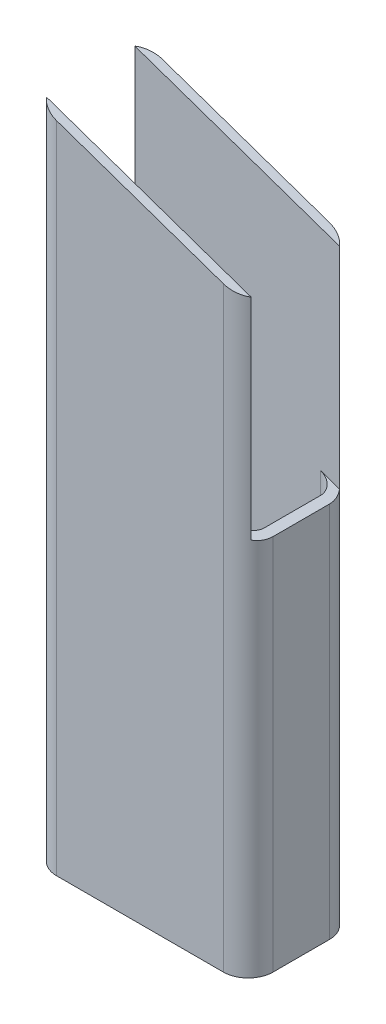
ISO-10303-21;
HEADER;
FILE_DESCRIPTION(('STEP AP214'),'2;1');
FILE_NAME('part.step','',(''),(''),'','','');
FILE_SCHEMA(('AUTOMOTIVE_DESIGN { 1 0 10303 214 1 1 1 1 }'));
ENDSEC;
DATA;
#1=APPLICATION_CONTEXT('core data for automotive mechanical design processes');
#2=APPLICATION_PROTOCOL_DEFINITION('international standard','automotive_design',2000,#1);
#3=PRODUCT_CONTEXT('',#1,'mechanical');
#4=PRODUCT('Part','Part','',(#3));
#5=PRODUCT_RELATED_PRODUCT_CATEGORY('part','',(#4));
#6=PRODUCT_DEFINITION_FORMATION('','',#4);
#7=PRODUCT_DEFINITION_CONTEXT('part definition',#1,'design');
#8=PRODUCT_DEFINITION('design','',#6,#7);
#9=PRODUCT_DEFINITION_SHAPE('','',#8);
#10=(LENGTH_UNIT() NAMED_UNIT(*) SI_UNIT(.MILLI.,.METRE.));
#11=(NAMED_UNIT(*) PLANE_ANGLE_UNIT() SI_UNIT($,.RADIAN.));
#12=(NAMED_UNIT(*) SI_UNIT($,.STERADIAN.) SOLID_ANGLE_UNIT());
#13=UNCERTAINTY_MEASURE_WITH_UNIT(LENGTH_MEASURE(1.E-05),#10,'distance_accuracy_value','');
#14=(GEOMETRIC_REPRESENTATION_CONTEXT(3) GLOBAL_UNCERTAINTY_ASSIGNED_CONTEXT((#13)) GLOBAL_UNIT_ASSIGNED_CONTEXT((#10,
#11,#12)) REPRESENTATION_CONTEXT('',''));
#15=CARTESIAN_POINT('',(0.,0.,0.));
#16=DIRECTION('',(0.,0.,1.));
#17=DIRECTION('',(1.,0.,0.));
#18=AXIS2_PLACEMENT_3D('',#15,#16,#17);
#19=CARTESIAN_POINT('',(98.,232.053333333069,-48.0000000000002));
#20=DIRECTION('',(-0.327543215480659,-0.944836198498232,0.));
#21=DIRECTION('',(0.944836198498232,-0.327543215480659,0.));
#22=AXIS2_PLACEMENT_3D('',#19,#20,#21);
#23=PLANE('',#22);
#24=DIRECTION('',(-0.944836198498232,0.327543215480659,0.));
#25=VECTOR('',#24,1.);
#26=CARTESIAN_POINT('',(-10.5138866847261,269.671480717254,-40.0000000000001));
#27=LINE('',#26,#25);
#28=CARTESIAN_POINT('',(92.7046505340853,233.88905448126,-40.));
#29=VERTEX_POINT('',#28);
#30=CARTESIAN_POINT('',(-92.7046505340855,298.164278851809,-40.));
#31=VERTEX_POINT('',#30);
#32=EDGE_CURVE('E187',#29,#31,#27,.T.);
#33=ORIENTED_EDGE('',*,*,#32,.F.);
#34=CARTESIAN_POINT('',(75.5,239.8533333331,-25.5000000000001));
#35=DIRECTION('',(-0.327543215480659,-0.944836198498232,0.));
#36=DIRECTION('',(0.944836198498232,-0.327543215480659,0.));
#37=AXIS2_PLACEMENT_3D('',#34,#35,#36);
#38=ELLIPSE('',#37,23.8136515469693,22.5);
#39=CARTESIAN_POINT('',(75.5,239.8533333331,-48.0000000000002));
#40=VERTEX_POINT('',#39);
#41=EDGE_CURVE('E202',#40,#29,#38,.T.);
#42=ORIENTED_EDGE('',*,*,#41,.F.);
#43=DIRECTION('',(0.944836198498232,-0.327543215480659,0.));
#44=VECTOR('',#43,1.);
#45=CARTESIAN_POINT('',(98.,232.053333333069,-48.0000000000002));
#46=LINE('',#45,#44);
#47=CARTESIAN_POINT('',(-75.5,292.19999999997,-48.0000000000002));
#48=VERTEX_POINT('',#47);
#49=EDGE_CURVE('E320',#48,#40,#46,.T.);
#50=ORIENTED_EDGE('',*,*,#49,.F.);
#51=CARTESIAN_POINT('',(-75.5,292.19999999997,-25.5000000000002));
#52=DIRECTION('',(-0.327543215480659,-0.944836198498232,0.));
#53=DIRECTION('',(0.944836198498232,-0.327543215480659,0.));
#54=AXIS2_PLACEMENT_3D('',#51,#52,#53);
#55=ELLIPSE('',#54,23.8136515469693,22.5);
#56=EDGE_CURVE('E208',#48,#31,#55,.F.);
#57=ORIENTED_EDGE('',*,*,#56,.T.);
#58=EDGE_LOOP('',(#33,#42,#50,#57));
#59=FACE_BOUND('',#58,.T.);
#60=ADVANCED_FACE('F40',(#59),#23,.F.);
#61=CARTESIAN_POINT('',(90.,300.,0.));
#62=DIRECTION('',(1.,0.,0.));
#63=DIRECTION('',(0.,0.,-1.));
#64=AXIS2_PLACEMENT_3D('',#61,#62,#63);
#65=PLANE('',#64);
#66=DIRECTION('',(0.,-1.,0.));
#67=VECTOR('',#66,1.);
#68=CARTESIAN_POINT('',(90.,300.,25.5));
#69=LINE('',#68,#67);
#70=CARTESIAN_POINT('',(90.,44.3166666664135,25.5));
#71=VERTEX_POINT('',#70);
#72=CARTESIAN_POINT('',(90.,-300.,25.5));
#73=VERTEX_POINT('',#72);
#74=EDGE_CURVE('E48',#71,#73,#69,.T.);
#75=ORIENTED_EDGE('',*,*,#74,.F.);
#76=DIRECTION('',(0.,0.,-1.));
#77=VECTOR('',#76,1.);
#78=CARTESIAN_POINT('',(90.,44.3166666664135,0.));
#79=LINE('',#78,#77);
#80=CARTESIAN_POINT('',(90.,44.3166666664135,-25.5000000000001));
#81=VERTEX_POINT('',#80);
#82=EDGE_CURVE('E357',#71,#81,#79,.T.);
#83=ORIENTED_EDGE('',*,*,#82,.T.);
#84=DIRECTION('',(0.,-1.,0.));
#85=VECTOR('',#84,1.);
#86=CARTESIAN_POINT('',(90.,300.,-25.5000000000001));
#87=LINE('',#86,#85);
#88=CARTESIAN_POINT('',(90.,-300.,-25.5000000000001));
#89=VERTEX_POINT('',#88);
#90=EDGE_CURVE('E63',#81,#89,#87,.T.);
#91=ORIENTED_EDGE('',*,*,#90,.T.);
#92=DIRECTION('',(0.,0.,1.));
#93=VECTOR('',#92,1.);
#94=CARTESIAN_POINT('',(90.,-300.,0.));
#95=LINE('',#94,#93);
#96=EDGE_CURVE('E232',#89,#73,#95,.T.);
#97=ORIENTED_EDGE('',*,*,#96,.T.);
#98=EDGE_LOOP('',(#75,#83,#91,#97));
#99=FACE_BOUND('',#98,.T.);
#100=ADVANCED_FACE('F408',(#99),#65,.F.);
#101=CARTESIAN_POINT('',(75.5,300.,25.5));
#102=DIRECTION('',(0.,-1.,0.));
#103=DIRECTION('',(0.,0.,-1.));
#104=AXIS2_PLACEMENT_3D('',#101,#102,#103);
#105=CYLINDRICAL_SURFACE('',#104,14.5);
#106=DIRECTION('',(0.,-1.,0.));
#107=VECTOR('',#106,1.);
#108=CARTESIAN_POINT('',(75.5,300.,40.));
#109=LINE('',#108,#107);
#110=CARTESIAN_POINT('',(75.5,49.3433333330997,40.));
#111=VERTEX_POINT('',#110);
#112=CARTESIAN_POINT('',(75.5,-300.,40.));
#113=VERTEX_POINT('',#112);
#114=EDGE_CURVE('E268',#111,#113,#109,.T.);
#115=ORIENTED_EDGE('',*,*,#114,.F.);
#116=CARTESIAN_POINT('',(75.5,49.3433333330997,25.5));
#117=DIRECTION('',(-0.327543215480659,-0.944836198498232,0.));
#118=DIRECTION('',(0.944836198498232,-0.327543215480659,0.));
#119=AXIS2_PLACEMENT_3D('',#116,#117,#118);
#120=ELLIPSE('',#119,15.3465754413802,14.5);
#121=EDGE_CURVE('E359',#111,#71,#120,.F.);
#122=ORIENTED_EDGE('',*,*,#121,.T.);
#123=ORIENTED_EDGE('',*,*,#74,.T.);
#124=CARTESIAN_POINT('',(75.5,-300.,25.5));
#125=DIRECTION('',(0.,1.,0.));
#126=DIRECTION('',(0.,0.,1.));
#127=AXIS2_PLACEMENT_3D('',#124,#125,#126);
#128=CIRCLE('',#127,14.5);
#129=EDGE_CURVE('E234',#73,#113,#128,.F.);
#130=ORIENTED_EDGE('',*,*,#129,.T.);
#131=EDGE_LOOP('',(#115,#122,#123,#130));
#132=FACE_BOUND('',#131,.T.);
#133=ADVANCED_FACE('F371',(#132),#105,.F.);
#134=CARTESIAN_POINT('',(0.,300.,40.));
#135=DIRECTION('',(0.,0.,-1.));
#136=DIRECTION('',(-1.,0.,0.));
#137=AXIS2_PLACEMENT_3D('',#134,#135,#136);
#138=PLANE('',#137);
#139=DIRECTION('',(0.,-1.,0.));
#140=VECTOR('',#139,1.);
#141=CARTESIAN_POINT('',(-75.5,300.,40.0000000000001));
#142=LINE('',#141,#140);
#143=CARTESIAN_POINT('',(-75.5,101.68999999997,40.));
#144=VERTEX_POINT('',#143);
#145=CARTESIAN_POINT('',(-75.5,-300.,40.0000000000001));
#146=VERTEX_POINT('',#145);
#147=EDGE_CURVE('E266',#144,#146,#142,.T.);
#148=ORIENTED_EDGE('',*,*,#147,.F.);
#149=DIRECTION('',(0.944836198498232,-0.327543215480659,0.));
#150=VECTOR('',#149,1.);
#151=CARTESIAN_POINT('',(-98.,109.49,40.));
#152=LINE('',#151,#150);
#153=CARTESIAN_POINT('',(-92.7046505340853,107.654278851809,40.));
#154=VERTEX_POINT('',#153);
#155=EDGE_CURVE('E364',#154,#144,#152,.T.);
#156=ORIENTED_EDGE('',*,*,#155,.F.);
#157=DIRECTION('',(0.,-1.,0.));
#158=VECTOR('',#157,1.);
#159=CARTESIAN_POINT('',(-92.7046505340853,300.,40.));
#160=LINE('',#159,#158);
#161=CARTESIAN_POINT('',(-92.7046505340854,298.164278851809,40.));
#162=VERTEX_POINT('',#161);
#163=EDGE_CURVE('E184',#162,#154,#160,.T.);
#164=ORIENTED_EDGE('',*,*,#163,.F.);
#165=DIRECTION('',(-0.944836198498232,0.327543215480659,0.));
#166=VECTOR('',#165,1.);
#167=CARTESIAN_POINT('',(-10.5138866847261,269.671480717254,40.));
#168=LINE('',#167,#166);
#169=CARTESIAN_POINT('',(92.7046505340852,233.88905448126,40.));
#170=VERTEX_POINT('',#169);
#171=EDGE_CURVE('E55',#170,#162,#168,.T.);
#172=ORIENTED_EDGE('',*,*,#171,.F.);
#173=DIRECTION('',(0.,-1.,0.));
#174=VECTOR('',#173,1.);
#175=CARTESIAN_POINT('',(92.7046505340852,300.,40.));
#176=LINE('',#175,#174);
#177=CARTESIAN_POINT('',(92.7046505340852,43.3790544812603,40.));
#178=VERTEX_POINT('',#177);
#179=EDGE_CURVE('E180',#170,#178,#176,.T.);
#180=ORIENTED_EDGE('',*,*,#179,.T.);
#181=EDGE_CURVE('E367',#111,#178,#152,.T.);
#182=ORIENTED_EDGE('',*,*,#181,.F.);
#183=ORIENTED_EDGE('',*,*,#114,.T.);
#184=DIRECTION('',(1.,0.,0.));
#185=VECTOR('',#184,1.);
#186=CARTESIAN_POINT('',(0.,-300.,40.));
#187=LINE('',#186,#185);
#188=EDGE_CURVE('E237',#146,#113,#187,.T.);
#189=ORIENTED_EDGE('',*,*,#188,.F.);
#190=EDGE_LOOP('',(#148,#156,#164,#172,#180,#182,#183,#189));
#191=FACE_BOUND('',#190,.T.);
#192=ADVANCED_FACE('F178',(#191),#138,.T.);
#193=CARTESIAN_POINT('',(-75.5,300.,25.5000000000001));
#194=DIRECTION('',(0.,-1.,0.));
#195=DIRECTION('',(0.,0.,-1.));
#196=AXIS2_PLACEMENT_3D('',#193,#194,#195);
#197=CYLINDRICAL_SURFACE('',#196,14.5);
#198=CARTESIAN_POINT('',(-75.5,101.68999999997,25.5000000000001));
#199=DIRECTION('',(-0.327543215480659,-0.944836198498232,0.));
#200=DIRECTION('',(0.944836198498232,-0.327543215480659,0.));
#201=AXIS2_PLACEMENT_3D('',#198,#199,#200);
#202=ELLIPSE('',#201,15.3465754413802,14.5);
#203=CARTESIAN_POINT('',(-90.,106.716666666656,25.5000000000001));
#204=VERTEX_POINT('',#203);
#205=EDGE_CURVE('E318',#144,#204,#202,.T.);
#206=ORIENTED_EDGE('',*,*,#205,.F.);
#207=ORIENTED_EDGE('',*,*,#147,.T.);
#208=CARTESIAN_POINT('',(-75.5,-300.,25.5000000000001));
#209=DIRECTION('',(0.,1.,0.));
#210=DIRECTION('',(0.,0.,1.));
#211=AXIS2_PLACEMENT_3D('',#208,#209,#210);
#212=CIRCLE('',#211,14.5);
#213=CARTESIAN_POINT('',(-90.,-300.,25.5000000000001));
#214=VERTEX_POINT('',#213);
#215=EDGE_CURVE('E240',#214,#146,#212,.T.);
#216=ORIENTED_EDGE('',*,*,#215,.F.);
#217=DIRECTION('',(0.,-1.,0.));
#218=VECTOR('',#217,1.);
#219=CARTESIAN_POINT('',(-90.,300.,25.5000000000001));
#220=LINE('',#219,#218);
#221=EDGE_CURVE('E264',#204,#214,#220,.T.);
#222=ORIENTED_EDGE('',*,*,#221,.F.);
#223=EDGE_LOOP('',(#206,#207,#216,#222));
#224=FACE_BOUND('',#223,.T.);
#225=ADVANCED_FACE('F379',(#224),#197,.F.);
#226=CARTESIAN_POINT('',(-90.,300.,0.));
#227=DIRECTION('',(1.,0.,0.));
#228=DIRECTION('',(0.,0.,-1.));
#229=AXIS2_PLACEMENT_3D('',#226,#227,#228);
#230=PLANE('',#229);
#231=DIRECTION('',(0.,0.,-1.));
#232=VECTOR('',#231,1.);
#233=CARTESIAN_POINT('',(-90.,106.716666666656,0.));
#234=LINE('',#233,#232);
#235=CARTESIAN_POINT('',(-90.,106.716666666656,-25.5000000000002));
#236=VERTEX_POINT('',#235);
#237=EDGE_CURVE('E316',#204,#236,#234,.T.);
#238=ORIENTED_EDGE('',*,*,#237,.F.);
#239=ORIENTED_EDGE('',*,*,#221,.T.);
#240=DIRECTION('',(0.,0.,1.));
#241=VECTOR('',#240,1.);
#242=CARTESIAN_POINT('',(-90.,-300.,0.));
#243=LINE('',#242,#241);
#244=CARTESIAN_POINT('',(-90.,-300.,-25.5000000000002));
#245=VERTEX_POINT('',#244);
#246=EDGE_CURVE('E243',#245,#214,#243,.T.);
#247=ORIENTED_EDGE('',*,*,#246,.F.);
#248=DIRECTION('',(0.,-1.,0.));
#249=VECTOR('',#248,1.);
#250=CARTESIAN_POINT('',(-90.,300.,-25.5000000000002));
#251=LINE('',#250,#249);
#252=EDGE_CURVE('E262',#236,#245,#251,.T.);
#253=ORIENTED_EDGE('',*,*,#252,.F.);
#254=EDGE_LOOP('',(#238,#239,#247,#253));
#255=FACE_BOUND('',#254,.T.);
#256=ADVANCED_FACE('F383',(#255),#230,.T.);
#257=CARTESIAN_POINT('',(-75.5,300.,-25.5000000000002));
#258=DIRECTION('',(0.,-1.,0.));
#259=DIRECTION('',(0.,0.,-1.));
#260=AXIS2_PLACEMENT_3D('',#257,#258,#259);
#261=CYLINDRICAL_SURFACE('',#260,14.5);
#262=DIRECTION('',(0.,-1.,0.));
#263=VECTOR('',#262,1.);
#264=CARTESIAN_POINT('',(-75.5,300.,-40.0000000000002));
#265=LINE('',#264,#263);
#266=CARTESIAN_POINT('',(-75.5,101.68999999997,-40.));
#267=VERTEX_POINT('',#266);
#268=CARTESIAN_POINT('',(-75.5,-300.,-40.0000000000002));
#269=VERTEX_POINT('',#268);
#270=EDGE_CURVE('E260',#267,#269,#265,.T.);
#271=ORIENTED_EDGE('',*,*,#270,.F.);
#272=CARTESIAN_POINT('',(-75.5,101.68999999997,-25.5000000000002));
#273=DIRECTION('',(-0.327543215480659,-0.944836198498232,0.));
#274=DIRECTION('',(0.944836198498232,-0.327543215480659,0.));
#275=AXIS2_PLACEMENT_3D('',#272,#273,#274);
#276=ELLIPSE('',#275,15.3465754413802,14.5);
#277=EDGE_CURVE('E308',#267,#236,#276,.F.);
#278=ORIENTED_EDGE('',*,*,#277,.T.);
#279=ORIENTED_EDGE('',*,*,#252,.T.);
#280=CARTESIAN_POINT('',(-75.5,-300.,-25.5000000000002));
#281=DIRECTION('',(0.,1.,0.));
#282=DIRECTION('',(0.,0.,1.));
#283=AXIS2_PLACEMENT_3D('',#280,#281,#282);
#284=CIRCLE('',#283,14.5);
#285=EDGE_CURVE('E246',#245,#269,#284,.F.);
#286=ORIENTED_EDGE('',*,*,#285,.T.);
#287=EDGE_LOOP('',(#271,#278,#279,#286));
#288=FACE_BOUND('',#287,.T.);
#289=ADVANCED_FACE('F386',(#288),#261,.F.);
#290=CARTESIAN_POINT('',(0.,300.,-40.0000000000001));
#291=DIRECTION('',(0.,0.,-1.));
#292=DIRECTION('',(-1.,0.,0.));
#293=AXIS2_PLACEMENT_3D('',#290,#291,#292);
#294=PLANE('',#293);
#295=DIRECTION('',(0.,-1.,0.));
#296=VECTOR('',#295,1.);
#297=CARTESIAN_POINT('',(75.5,300.,-40.0000000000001));
#298=LINE('',#297,#296);
#299=CARTESIAN_POINT('',(75.5,49.3433333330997,-40.));
#300=VERTEX_POINT('',#299);
#301=CARTESIAN_POINT('',(75.5,-300.,-40.0000000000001));
#302=VERTEX_POINT('',#301);
#303=EDGE_CURVE('E257',#300,#302,#298,.T.);
#304=ORIENTED_EDGE('',*,*,#303,.F.);
#305=DIRECTION('',(0.944836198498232,-0.327543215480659,0.));
#306=VECTOR('',#305,1.);
#307=CARTESIAN_POINT('',(-98.,109.49,-40.));
#308=LINE('',#307,#306);
#309=CARTESIAN_POINT('',(92.7046505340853,43.3790544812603,-40.));
#310=VERTEX_POINT('',#309);
#311=EDGE_CURVE('E350',#300,#310,#308,.T.);
#312=ORIENTED_EDGE('',*,*,#311,.T.);
#313=DIRECTION('',(0.,-1.,0.));
#314=VECTOR('',#313,1.);
#315=CARTESIAN_POINT('',(92.7046505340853,300.,-40.));
#316=LINE('',#315,#314);
#317=EDGE_CURVE('E303',#310,#29,#316,.F.);
#318=ORIENTED_EDGE('',*,*,#317,.T.);
#319=ORIENTED_EDGE('',*,*,#32,.T.);
#320=DIRECTION('',(0.,-1.,0.));
#321=VECTOR('',#320,1.);
#322=CARTESIAN_POINT('',(-92.7046505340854,300.,-40.));
#323=LINE('',#322,#321);
#324=CARTESIAN_POINT('',(-92.7046505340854,107.654278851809,-40.));
#325=VERTEX_POINT('',#324);
#326=EDGE_CURVE('E196',#325,#31,#323,.F.);
#327=ORIENTED_EDGE('',*,*,#326,.F.);
#328=EDGE_CURVE('E346',#325,#267,#308,.T.);
#329=ORIENTED_EDGE('',*,*,#328,.T.);
#330=ORIENTED_EDGE('',*,*,#270,.T.);
#331=DIRECTION('',(1.,0.,0.));
#332=VECTOR('',#331,1.);
#333=CARTESIAN_POINT('',(0.,-300.,-40.0000000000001));
#334=LINE('',#333,#332);
#335=EDGE_CURVE('E249',#269,#302,#334,.T.);
#336=ORIENTED_EDGE('',*,*,#335,.T.);
#337=EDGE_LOOP('',(#304,#312,#318,#319,#327,#329,#330,#336));
#338=FACE_BOUND('',#337,.T.);
#339=ADVANCED_FACE('F391',(#338),#294,.F.);
#340=CARTESIAN_POINT('',(75.5,300.,25.5));
#341=DIRECTION('',(0.,-1.,0.));
#342=DIRECTION('',(0.,0.,-1.));
#343=AXIS2_PLACEMENT_3D('',#340,#341,#342);
#344=CYLINDRICAL_SURFACE('',#343,22.5);
#345=CARTESIAN_POINT('',(75.5,49.3433333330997,25.5));
#346=DIRECTION('',(-0.327543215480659,-0.944836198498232,0.));
#347=DIRECTION('',(0.944836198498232,-0.327543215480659,0.));
#348=AXIS2_PLACEMENT_3D('',#345,#346,#347);
#349=ELLIPSE('',#348,23.8136515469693,22.5);
#350=CARTESIAN_POINT('',(98.,41.5433333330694,25.5));
#351=VERTEX_POINT('',#350);
#352=EDGE_CURVE('E195',#178,#351,#349,.F.);
#353=ORIENTED_EDGE('',*,*,#352,.F.);
#354=ORIENTED_EDGE('',*,*,#179,.F.);
#355=CARTESIAN_POINT('',(75.5,239.8533333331,25.5));
#356=DIRECTION('',(-0.327543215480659,-0.944836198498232,0.));
#357=DIRECTION('',(0.944836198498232,-0.327543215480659,0.));
#358=AXIS2_PLACEMENT_3D('',#355,#356,#357);
#359=ELLIPSE('',#358,23.8136515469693,22.5);
#360=CARTESIAN_POINT('',(75.5,239.8533333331,48.));
#361=VERTEX_POINT('',#360);
#362=EDGE_CURVE('E192',#361,#170,#359,.F.);
#363=ORIENTED_EDGE('',*,*,#362,.F.);
#364=DIRECTION('',(0.,-1.,0.));
#365=VECTOR('',#364,1.);
#366=CARTESIAN_POINT('',(75.5,300.,48.));
#367=LINE('',#366,#365);
#368=CARTESIAN_POINT('',(75.5,-300.,48.));
#369=VERTEX_POINT('',#368);
#370=EDGE_CURVE('E255',#361,#369,#367,.T.);
#371=ORIENTED_EDGE('',*,*,#370,.T.);
#372=CARTESIAN_POINT('',(75.5,-300.,25.5));
#373=DIRECTION('',(0.,1.,0.));
#374=DIRECTION('',(0.,0.,1.));
#375=AXIS2_PLACEMENT_3D('',#372,#373,#374);
#376=CIRCLE('',#375,22.5);
#377=CARTESIAN_POINT('',(98.,-300.,25.5));
#378=VERTEX_POINT('',#377);
#379=EDGE_CURVE('E201',#378,#369,#376,.F.);
#380=ORIENTED_EDGE('',*,*,#379,.F.);
#381=DIRECTION('',(0.,-1.,0.));
#382=VECTOR('',#381,1.);
#383=CARTESIAN_POINT('',(98.,300.,25.5));
#384=LINE('',#383,#382);
#385=EDGE_CURVE('E258',#351,#378,#384,.T.);
#386=ORIENTED_EDGE('',*,*,#385,.F.);
#387=EDGE_LOOP('',(#353,#354,#363,#371,#380,#386));
#388=FACE_BOUND('',#387,.T.);
#389=ADVANCED_FACE('F42',(#388),#344,.T.);
#390=CARTESIAN_POINT('',(98.,300.,0.));
#391=DIRECTION('',(1.,0.,0.));
#392=DIRECTION('',(0.,0.,-1.));
#393=AXIS2_PLACEMENT_3D('',#390,#391,#392);
#394=PLANE('',#393);
#395=DIRECTION('',(0.,0.,1.));
#396=VECTOR('',#395,1.);
#397=CARTESIAN_POINT('',(98.,41.5433333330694,-40.));
#398=LINE('',#397,#396);
#399=CARTESIAN_POINT('',(98.,41.5433333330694,-25.5000000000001));
#400=VERTEX_POINT('',#399);
#401=EDGE_CURVE('E289',#400,#351,#398,.T.);
#402=ORIENTED_EDGE('',*,*,#401,.T.);
#403=ORIENTED_EDGE('',*,*,#385,.T.);
#404=DIRECTION('',(0.,0.,1.));
#405=VECTOR('',#404,1.);
#406=CARTESIAN_POINT('',(98.,-300.,0.));
#407=LINE('',#406,#405);
#408=CARTESIAN_POINT('',(98.,-300.,-25.5000000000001));
#409=VERTEX_POINT('',#408);
#410=EDGE_CURVE('E205',#409,#378,#407,.T.);
#411=ORIENTED_EDGE('',*,*,#410,.F.);
#412=DIRECTION('',(0.,-1.,0.));
#413=VECTOR('',#412,1.);
#414=CARTESIAN_POINT('',(98.,300.,-25.5000000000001));
#415=LINE('',#414,#413);
#416=EDGE_CURVE('E282',#400,#409,#415,.T.);
#417=ORIENTED_EDGE('',*,*,#416,.F.);
#418=EDGE_LOOP('',(#402,#403,#411,#417));
#419=FACE_BOUND('',#418,.T.);
#420=ADVANCED_FACE('F287',(#419),#394,.T.);
#421=CARTESIAN_POINT('',(75.5,300.,-25.5000000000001));
#422=DIRECTION('',(0.,-1.,0.));
#423=DIRECTION('',(0.,0.,-1.));
#424=AXIS2_PLACEMENT_3D('',#421,#422,#423);
#425=CYLINDRICAL_SURFACE('',#424,22.5);
#426=ORIENTED_EDGE('',*,*,#317,.F.);
#427=CARTESIAN_POINT('',(75.5,49.3433333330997,-25.5000000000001));
#428=DIRECTION('',(-0.327543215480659,-0.944836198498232,0.));
#429=DIRECTION('',(0.944836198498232,-0.327543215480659,0.));
#430=AXIS2_PLACEMENT_3D('',#427,#428,#429);
#431=ELLIPSE('',#430,23.8136515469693,22.5);
#432=EDGE_CURVE('E301',#310,#400,#431,.T.);
#433=ORIENTED_EDGE('',*,*,#432,.T.);
#434=ORIENTED_EDGE('',*,*,#416,.T.);
#435=CARTESIAN_POINT('',(75.5,-300.,-25.5000000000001));
#436=DIRECTION('',(0.,1.,0.));
#437=DIRECTION('',(0.,0.,1.));
#438=AXIS2_PLACEMENT_3D('',#435,#436,#437);
#439=CIRCLE('',#438,22.5);
#440=CARTESIAN_POINT('',(75.5,-300.,-48.0000000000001));
#441=VERTEX_POINT('',#440);
#442=EDGE_CURVE('E214',#409,#441,#439,.T.);
#443=ORIENTED_EDGE('',*,*,#442,.T.);
#444=DIRECTION('',(0.,-1.,0.));
#445=VECTOR('',#444,1.);
#446=CARTESIAN_POINT('',(75.5,300.,-48.0000000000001));
#447=LINE('',#446,#445);
#448=EDGE_CURVE('E280',#40,#441,#447,.T.);
#449=ORIENTED_EDGE('',*,*,#448,.F.);
#450=ORIENTED_EDGE('',*,*,#41,.T.);
#451=EDGE_LOOP('',(#426,#433,#434,#443,#449,#450));
#452=FACE_BOUND('',#451,.T.);
#453=ADVANCED_FACE('F299',(#452),#425,.T.);
#454=CARTESIAN_POINT('',(0.,300.,-48.0000000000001));
#455=DIRECTION('',(0.,0.,-1.));
#456=DIRECTION('',(-1.,0.,0.));
#457=AXIS2_PLACEMENT_3D('',#454,#455,#456);
#458=PLANE('',#457);
#459=ORIENTED_EDGE('',*,*,#49,.T.);
#460=ORIENTED_EDGE('',*,*,#448,.T.);
#461=DIRECTION('',(1.,0.,0.));
#462=VECTOR('',#461,1.);
#463=CARTESIAN_POINT('',(0.,-300.,-48.0000000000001));
#464=LINE('',#463,#462);
#465=CARTESIAN_POINT('',(-75.5,-300.,-48.0000000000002));
#466=VERTEX_POINT('',#465);
#467=EDGE_CURVE('E217',#466,#441,#464,.T.);
#468=ORIENTED_EDGE('',*,*,#467,.F.);
#469=DIRECTION('',(0.,-1.,0.));
#470=VECTOR('',#469,1.);
#471=CARTESIAN_POINT('',(-75.5,300.,-48.0000000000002));
#472=LINE('',#471,#470);
#473=EDGE_CURVE('E278',#48,#466,#472,.T.);
#474=ORIENTED_EDGE('',*,*,#473,.F.);
#475=EDGE_LOOP('',(#459,#460,#468,#474));
#476=FACE_BOUND('',#475,.T.);
#477=ADVANCED_FACE('F335',(#476),#458,.T.);
#478=CARTESIAN_POINT('',(-75.5,300.,-25.5000000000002));
#479=DIRECTION('',(0.,-1.,0.));
#480=DIRECTION('',(0.,0.,-1.));
#481=AXIS2_PLACEMENT_3D('',#478,#479,#480);
#482=CYLINDRICAL_SURFACE('',#481,22.5);
#483=CARTESIAN_POINT('',(-75.5,101.68999999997,-25.5000000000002));
#484=DIRECTION('',(-0.327543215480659,-0.944836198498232,0.));
#485=DIRECTION('',(0.944836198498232,-0.327543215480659,0.));
#486=AXIS2_PLACEMENT_3D('',#483,#484,#485);
#487=ELLIPSE('',#486,23.8136515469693,22.5);
#488=CARTESIAN_POINT('',(-98.,109.49,-25.5000000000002));
#489=VERTEX_POINT('',#488);
#490=EDGE_CURVE('E306',#325,#489,#487,.F.);
#491=ORIENTED_EDGE('',*,*,#490,.F.);
#492=ORIENTED_EDGE('',*,*,#326,.T.);
#493=ORIENTED_EDGE('',*,*,#56,.F.);
#494=ORIENTED_EDGE('',*,*,#473,.T.);
#495=CARTESIAN_POINT('',(-75.5,-300.,-25.5000000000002));
#496=DIRECTION('',(0.,1.,0.));
#497=DIRECTION('',(0.,0.,1.));
#498=AXIS2_PLACEMENT_3D('',#495,#496,#497);
#499=CIRCLE('',#498,22.5);
#500=CARTESIAN_POINT('',(-98.,-300.,-25.5000000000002));
#501=VERTEX_POINT('',#500);
#502=EDGE_CURVE('E220',#501,#466,#499,.F.);
#503=ORIENTED_EDGE('',*,*,#502,.F.);
#504=DIRECTION('',(0.,-1.,0.));
#505=VECTOR('',#504,1.);
#506=CARTESIAN_POINT('',(-98.,300.,-25.5000000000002));
#507=LINE('',#506,#505);
#508=EDGE_CURVE('E276',#489,#501,#507,.T.);
#509=ORIENTED_EDGE('',*,*,#508,.F.);
#510=EDGE_LOOP('',(#491,#492,#493,#494,#503,#509));
#511=FACE_BOUND('',#510,.T.);
#512=ADVANCED_FACE('F332',(#511),#482,.T.);
#513=CARTESIAN_POINT('',(-98.,300.,0.));
#514=DIRECTION('',(1.,0.,0.));
#515=DIRECTION('',(0.,0.,-1.));
#516=AXIS2_PLACEMENT_3D('',#513,#514,#515);
#517=PLANE('',#516);
#518=DIRECTION('',(0.,-1.,0.));
#519=VECTOR('',#518,1.);
#520=CARTESIAN_POINT('',(-98.,300.,25.5000000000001));
#521=LINE('',#520,#519);
#522=CARTESIAN_POINT('',(-98.,109.49,25.5000000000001));
#523=VERTEX_POINT('',#522);
#524=CARTESIAN_POINT('',(-98.,-300.,25.5000000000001));
#525=VERTEX_POINT('',#524);
#526=EDGE_CURVE('E274',#523,#525,#521,.T.);
#527=ORIENTED_EDGE('',*,*,#526,.F.);
#528=DIRECTION('',(0.,0.,1.));
#529=VECTOR('',#528,1.);
#530=CARTESIAN_POINT('',(-98.,109.49,-40.));
#531=LINE('',#530,#529);
#532=EDGE_CURVE('E343',#489,#523,#531,.T.);
#533=ORIENTED_EDGE('',*,*,#532,.F.);
#534=ORIENTED_EDGE('',*,*,#508,.T.);
#535=DIRECTION('',(0.,0.,1.));
#536=VECTOR('',#535,1.);
#537=CARTESIAN_POINT('',(-98.,-300.,0.));
#538=LINE('',#537,#536);
#539=EDGE_CURVE('E223',#501,#525,#538,.T.);
#540=ORIENTED_EDGE('',*,*,#539,.T.);
#541=EDGE_LOOP('',(#527,#533,#534,#540));
#542=FACE_BOUND('',#541,.T.);
#543=ADVANCED_FACE('F342',(#542),#517,.F.);
#544=CARTESIAN_POINT('',(-75.5,300.,25.5000000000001));
#545=DIRECTION('',(0.,-1.,0.));
#546=DIRECTION('',(0.,0.,-1.));
#547=AXIS2_PLACEMENT_3D('',#544,#545,#546);
#548=CYLINDRICAL_SURFACE('',#547,22.5);
#549=ORIENTED_EDGE('',*,*,#163,.T.);
#550=CARTESIAN_POINT('',(-75.5,101.68999999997,25.5000000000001));
#551=DIRECTION('',(-0.327543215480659,-0.944836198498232,0.));
#552=DIRECTION('',(0.944836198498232,-0.327543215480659,0.));
#553=AXIS2_PLACEMENT_3D('',#550,#551,#552);
#554=ELLIPSE('',#553,23.8136515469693,22.5);
#555=EDGE_CURVE('E310',#154,#523,#554,.T.);
#556=ORIENTED_EDGE('',*,*,#555,.T.);
#557=ORIENTED_EDGE('',*,*,#526,.T.);
#558=CARTESIAN_POINT('',(-75.5,-300.,25.5000000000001));
#559=DIRECTION('',(0.,1.,0.));
#560=DIRECTION('',(0.,0.,1.));
#561=AXIS2_PLACEMENT_3D('',#558,#559,#560);
#562=CIRCLE('',#561,22.5);
#563=CARTESIAN_POINT('',(-75.5,-300.,48.0000000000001));
#564=VERTEX_POINT('',#563);
#565=EDGE_CURVE('E226',#525,#564,#562,.T.);
#566=ORIENTED_EDGE('',*,*,#565,.T.);
#567=DIRECTION('',(0.,-1.,0.));
#568=VECTOR('',#567,1.);
#569=CARTESIAN_POINT('',(-75.5,300.,48.0000000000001));
#570=LINE('',#569,#568);
#571=CARTESIAN_POINT('',(-75.5,292.19999999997,48.));
#572=VERTEX_POINT('',#571);
#573=EDGE_CURVE('E272',#572,#564,#570,.T.);
#574=ORIENTED_EDGE('',*,*,#573,.F.);
#575=CARTESIAN_POINT('',(-75.5,292.19999999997,25.5000000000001));
#576=DIRECTION('',(-0.327543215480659,-0.944836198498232,0.));
#577=DIRECTION('',(0.944836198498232,-0.327543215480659,0.));
#578=AXIS2_PLACEMENT_3D('',#575,#576,#577);
#579=ELLIPSE('',#578,23.8136515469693,22.5);
#580=EDGE_CURVE('E186',#572,#162,#579,.T.);
#581=ORIENTED_EDGE('',*,*,#580,.T.);
#582=EDGE_LOOP('',(#549,#556,#557,#566,#574,#581));
#583=FACE_BOUND('',#582,.T.);
#584=ADVANCED_FACE('F362',(#583),#548,.T.);
#585=CARTESIAN_POINT('',(0.,300.,48.));
#586=DIRECTION('',(0.,0.,-1.));
#587=DIRECTION('',(-1.,0.,0.));
#588=AXIS2_PLACEMENT_3D('',#585,#586,#587);
#589=PLANE('',#588);
#590=ORIENTED_EDGE('',*,*,#370,.F.);
#591=DIRECTION('',(0.944836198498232,-0.327543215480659,0.));
#592=VECTOR('',#591,1.);
#593=CARTESIAN_POINT('',(98.,232.053333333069,48.));
#594=LINE('',#593,#592);
#595=EDGE_CURVE('E200',#572,#361,#594,.T.);
#596=ORIENTED_EDGE('',*,*,#595,.F.);
#597=ORIENTED_EDGE('',*,*,#573,.T.);
#598=DIRECTION('',(1.,0.,0.));
#599=VECTOR('',#598,1.);
#600=CARTESIAN_POINT('',(0.,-300.,48.));
#601=LINE('',#600,#599);
#602=EDGE_CURVE('E229',#564,#369,#601,.T.);
#603=ORIENTED_EDGE('',*,*,#602,.T.);
#604=EDGE_LOOP('',(#590,#596,#597,#603));
#605=FACE_BOUND('',#604,.T.);
#606=ADVANCED_FACE('F397',(#605),#589,.F.);
#607=CARTESIAN_POINT('',(75.5,300.,-25.5000000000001));
#608=DIRECTION('',(0.,-1.,0.));
#609=DIRECTION('',(0.,0.,-1.));
#610=AXIS2_PLACEMENT_3D('',#607,#608,#609);
#611=CYLINDRICAL_SURFACE('',#610,14.5);
#612=CARTESIAN_POINT('',(75.5,49.3433333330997,-25.5000000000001));
#613=DIRECTION('',(-0.327543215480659,-0.944836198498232,0.));
#614=DIRECTION('',(0.944836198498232,-0.327543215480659,0.));
#615=AXIS2_PLACEMENT_3D('',#612,#613,#614);
#616=ELLIPSE('',#615,15.3465754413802,14.5);
#617=EDGE_CURVE('E11',#300,#81,#616,.T.);
#618=ORIENTED_EDGE('',*,*,#617,.F.);
#619=ORIENTED_EDGE('',*,*,#303,.T.);
#620=CARTESIAN_POINT('',(75.5,-300.,-25.5000000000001));
#621=DIRECTION('',(0.,1.,0.));
#622=DIRECTION('',(0.,0.,1.));
#623=AXIS2_PLACEMENT_3D('',#620,#621,#622);
#624=CIRCLE('',#623,14.5);
#625=EDGE_CURVE('E252',#89,#302,#624,.T.);
#626=ORIENTED_EDGE('',*,*,#625,.F.);
#627=ORIENTED_EDGE('',*,*,#90,.F.);
#628=EDGE_LOOP('',(#618,#619,#626,#627));
#629=FACE_BOUND('',#628,.T.);
#630=ADVANCED_FACE('F395',(#629),#611,.F.);
#631=CARTESIAN_POINT('',(0.,-300.,0.));
#632=DIRECTION('',(0.,1.,0.));
#633=DIRECTION('',(0.,0.,1.));
#634=AXIS2_PLACEMENT_3D('',#631,#632,#633);
#635=PLANE('',#634);
#636=ORIENTED_EDGE('',*,*,#379,.T.);
#637=ORIENTED_EDGE('',*,*,#602,.F.);
#638=ORIENTED_EDGE('',*,*,#565,.F.);
#639=ORIENTED_EDGE('',*,*,#539,.F.);
#640=ORIENTED_EDGE('',*,*,#502,.T.);
#641=ORIENTED_EDGE('',*,*,#467,.T.);
#642=ORIENTED_EDGE('',*,*,#442,.F.);
#643=ORIENTED_EDGE('',*,*,#410,.T.);
#644=EDGE_LOOP('',(#636,#637,#638,#639,#640,#641,#642,#643));
#645=FACE_BOUND('',#644,.T.);
#646=ORIENTED_EDGE('',*,*,#96,.F.);
#647=ORIENTED_EDGE('',*,*,#625,.T.);
#648=ORIENTED_EDGE('',*,*,#335,.F.);
#649=ORIENTED_EDGE('',*,*,#285,.F.);
#650=ORIENTED_EDGE('',*,*,#246,.T.);
#651=ORIENTED_EDGE('',*,*,#215,.T.);
#652=ORIENTED_EDGE('',*,*,#188,.T.);
#653=ORIENTED_EDGE('',*,*,#129,.F.);
#654=EDGE_LOOP('',(#646,#647,#648,#649,#650,#651,#652,#653));
#655=FACE_BOUND('',#654,.T.);
#656=ADVANCED_FACE('F293',(#645,#655),#635,.F.);
#657=ORIENTED_EDGE('',*,*,#362,.T.);
#658=ORIENTED_EDGE('',*,*,#171,.T.);
#659=ORIENTED_EDGE('',*,*,#580,.F.);
#660=ORIENTED_EDGE('',*,*,#595,.T.);
#661=EDGE_LOOP('',(#657,#658,#659,#660));
#662=FACE_BOUND('',#661,.T.);
#663=ADVANCED_FACE('F198',(#662),#23,.F.);
#664=CARTESIAN_POINT('',(-98.,109.49,-40.));
#665=DIRECTION('',(-0.327543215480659,-0.944836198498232,0.));
#666=DIRECTION('',(0.944836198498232,-0.327543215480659,0.));
#667=AXIS2_PLACEMENT_3D('',#664,#665,#666);
#668=PLANE('',#667);
#669=ORIENTED_EDGE('',*,*,#205,.T.);
#670=ORIENTED_EDGE('',*,*,#237,.T.);
#671=ORIENTED_EDGE('',*,*,#277,.F.);
#672=ORIENTED_EDGE('',*,*,#328,.F.);
#673=ORIENTED_EDGE('',*,*,#490,.T.);
#674=ORIENTED_EDGE('',*,*,#532,.T.);
#675=ORIENTED_EDGE('',*,*,#555,.F.);
#676=ORIENTED_EDGE('',*,*,#155,.T.);
#677=EDGE_LOOP('',(#669,#670,#671,#672,#673,#674,#675,#676));
#678=FACE_BOUND('',#677,.T.);
#679=ADVANCED_FACE('F363',(#678),#668,.F.);
#680=ORIENTED_EDGE('',*,*,#352,.T.);
#681=ORIENTED_EDGE('',*,*,#401,.F.);
#682=ORIENTED_EDGE('',*,*,#432,.F.);
#683=ORIENTED_EDGE('',*,*,#311,.F.);
#684=ORIENTED_EDGE('',*,*,#617,.T.);
#685=ORIENTED_EDGE('',*,*,#82,.F.);
#686=ORIENTED_EDGE('',*,*,#121,.F.);
#687=ORIENTED_EDGE('',*,*,#181,.T.);
#688=EDGE_LOOP('',(#680,#681,#682,#683,#684,#685,#686,#687));
#689=FACE_BOUND('',#688,.T.);
#690=ADVANCED_FACE('F368',(#689),#668,.F.);
#691=CLOSED_SHELL('',(#60,#100,#133,#192,#225,#256,#289,#339,#389,#420,#453,#477,#512,#543,#584,
#606,#630,#656,#663,#679,#690));
#692=MANIFOLD_SOLID_BREP('B2',#691);
#693=ADVANCED_BREP_SHAPE_REPRESENTATION('',(#18,#692),#14);
#694=SHAPE_DEFINITION_REPRESENTATION(#9,#693);
ENDSEC;
END-ISO-10303-21;
